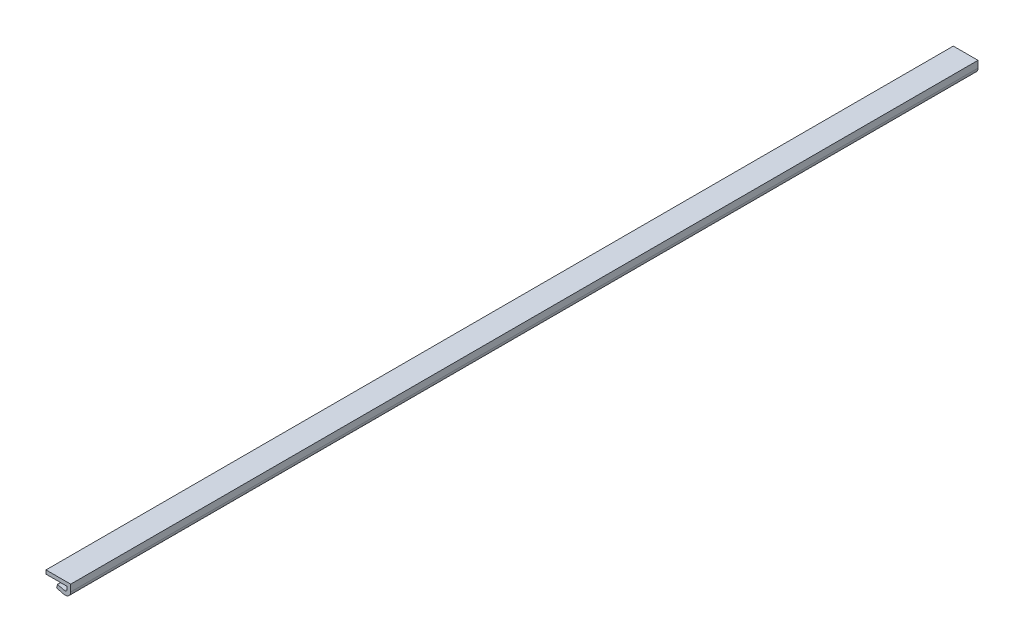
ISO-10303-21;
HEADER;
FILE_DESCRIPTION(('STEP AP214'),'2;1');
FILE_NAME('part.step','',(''),(''),'','','');
FILE_SCHEMA(('AUTOMOTIVE_DESIGN { 1 0 10303 214 1 1 1 1 }'));
ENDSEC;
DATA;
#1=APPLICATION_CONTEXT('core data for automotive mechanical design processes');
#2=APPLICATION_PROTOCOL_DEFINITION('international standard','automotive_design',2000,#1);
#3=PRODUCT_CONTEXT('',#1,'mechanical');
#4=PRODUCT('Part','Part','',(#3));
#5=PRODUCT_RELATED_PRODUCT_CATEGORY('part','',(#4));
#6=PRODUCT_DEFINITION_FORMATION('','',#4);
#7=PRODUCT_DEFINITION_CONTEXT('part definition',#1,'design');
#8=PRODUCT_DEFINITION('design','',#6,#7);
#9=PRODUCT_DEFINITION_SHAPE('','',#8);
#10=(LENGTH_UNIT() NAMED_UNIT(*) SI_UNIT(.MILLI.,.METRE.));
#11=(NAMED_UNIT(*) PLANE_ANGLE_UNIT() SI_UNIT($,.RADIAN.));
#12=(NAMED_UNIT(*) SI_UNIT($,.STERADIAN.) SOLID_ANGLE_UNIT());
#13=UNCERTAINTY_MEASURE_WITH_UNIT(LENGTH_MEASURE(1.E-05),#10,'distance_accuracy_value','');
#14=(GEOMETRIC_REPRESENTATION_CONTEXT(3) GLOBAL_UNCERTAINTY_ASSIGNED_CONTEXT((#13)) GLOBAL_UNIT_ASSIGNED_CONTEXT((#10,
#11,#12)) REPRESENTATION_CONTEXT('',''));
#15=CARTESIAN_POINT('',(0.,0.,0.));
#16=DIRECTION('',(0.,0.,1.));
#17=DIRECTION('',(1.,0.,0.));
#18=AXIS2_PLACEMENT_3D('',#15,#16,#17);
#19=CARTESIAN_POINT('',(0.,0.,735.));
#20=DIRECTION('',(1.,0.,0.));
#21=DIRECTION('',(0.,1.,0.));
#22=AXIS2_PLACEMENT_3D('',#19,#20,#21);
#23=PLANE('',#22);
#24=DIRECTION('',(0.,-1.,0.));
#25=VECTOR('',#24,1.);
#26=CARTESIAN_POINT('',(0.,0.,0.));
#27=LINE('',#26,#25);
#28=CARTESIAN_POINT('',(0.,0.,0.));
#29=VERTEX_POINT('',#28);
#30=CARTESIAN_POINT('',(0.,-3.,0.));
#31=VERTEX_POINT('',#30);
#32=EDGE_CURVE('E119',#29,#31,#27,.T.);
#33=ORIENTED_EDGE('',*,*,#32,.T.);
#34=DIRECTION('',(0.,0.,-1.));
#35=VECTOR('',#34,1.);
#36=CARTESIAN_POINT('',(0.,-3.,735.));
#37=LINE('',#36,#35);
#38=CARTESIAN_POINT('',(0.,-3.,735.));
#39=VERTEX_POINT('',#38);
#40=EDGE_CURVE('E11',#39,#31,#37,.T.);
#41=ORIENTED_EDGE('',*,*,#40,.F.);
#42=DIRECTION('',(0.,-1.,0.));
#43=VECTOR('',#42,1.);
#44=CARTESIAN_POINT('',(0.,0.,735.));
#45=LINE('',#44,#43);
#46=CARTESIAN_POINT('',(0.,0.,735.));
#47=VERTEX_POINT('',#46);
#48=EDGE_CURVE('E162',#47,#39,#45,.T.);
#49=ORIENTED_EDGE('',*,*,#48,.F.);
#50=DIRECTION('',(0.,0.,-1.));
#51=VECTOR('',#50,1.);
#52=CARTESIAN_POINT('',(0.,0.,735.));
#53=LINE('',#52,#51);
#54=EDGE_CURVE('E133',#47,#29,#53,.T.);
#55=ORIENTED_EDGE('',*,*,#54,.T.);
#56=EDGE_LOOP('',(#33,#41,#49,#55));
#57=FACE_BOUND('',#56,.T.);
#58=ADVANCED_FACE('F38',(#57),#23,.F.);
#59=CARTESIAN_POINT('',(0.,-3.,735.));
#60=DIRECTION('',(0.,1.,0.));
#61=DIRECTION('',(-1.,0.,0.));
#62=AXIS2_PLACEMENT_3D('',#59,#60,#61);
#63=PLANE('',#62);
#64=DIRECTION('',(1.,0.,0.));
#65=VECTOR('',#64,1.);
#66=CARTESIAN_POINT('',(0.,-3.,0.));
#67=LINE('',#66,#65);
#68=CARTESIAN_POINT('',(17.,-3.,0.));
#69=VERTEX_POINT('',#68);
#70=EDGE_CURVE('E115',#31,#69,#67,.T.);
#71=ORIENTED_EDGE('',*,*,#70,.T.);
#72=DIRECTION('',(0.,0.,-1.));
#73=VECTOR('',#72,1.);
#74=CARTESIAN_POINT('',(17.,-3.,735.));
#75=LINE('',#74,#73);
#76=CARTESIAN_POINT('',(17.,-3.,735.));
#77=VERTEX_POINT('',#76);
#78=EDGE_CURVE('E46',#77,#69,#75,.T.);
#79=ORIENTED_EDGE('',*,*,#78,.F.);
#80=DIRECTION('',(1.,0.,0.));
#81=VECTOR('',#80,1.);
#82=CARTESIAN_POINT('',(0.,-3.,735.));
#83=LINE('',#82,#81);
#84=EDGE_CURVE('E129',#39,#77,#83,.T.);
#85=ORIENTED_EDGE('',*,*,#84,.F.);
#86=ORIENTED_EDGE('',*,*,#40,.T.);
#87=EDGE_LOOP('',(#71,#79,#85,#86));
#88=FACE_BOUND('',#87,.T.);
#89=ADVANCED_FACE('F128',(#88),#63,.F.);
#90=CARTESIAN_POINT('',(17.,-3.,735.));
#91=DIRECTION('',(1.,0.,0.));
#92=DIRECTION('',(0.,0.,-1.));
#93=AXIS2_PLACEMENT_3D('',#90,#91,#92);
#94=PLANE('',#93);
#95=DIRECTION('',(0.,-1.,0.));
#96=VECTOR('',#95,1.);
#97=CARTESIAN_POINT('',(17.,-3.,0.));
#98=LINE('',#97,#96);
#99=CARTESIAN_POINT('',(17.,-5.49999999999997,0.));
#100=VERTEX_POINT('',#99);
#101=EDGE_CURVE('E121',#69,#100,#98,.T.);
#102=ORIENTED_EDGE('',*,*,#101,.T.);
#103=DIRECTION('',(0.,0.,-1.));
#104=VECTOR('',#103,1.);
#105=CARTESIAN_POINT('',(17.,-5.49999999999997,735.));
#106=LINE('',#105,#104);
#107=CARTESIAN_POINT('',(17.,-5.49999999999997,735.));
#108=VERTEX_POINT('',#107);
#109=EDGE_CURVE('E213',#108,#100,#106,.T.);
#110=ORIENTED_EDGE('',*,*,#109,.F.);
#111=DIRECTION('',(0.,-1.,0.));
#112=VECTOR('',#111,1.);
#113=CARTESIAN_POINT('',(17.,-3.,735.));
#114=LINE('',#113,#112);
#115=EDGE_CURVE('E167',#77,#108,#114,.T.);
#116=ORIENTED_EDGE('',*,*,#115,.F.);
#117=ORIENTED_EDGE('',*,*,#78,.T.);
#118=EDGE_LOOP('',(#102,#110,#116,#117));
#119=FACE_BOUND('',#118,.T.);
#120=ADVANCED_FACE('F219',(#119),#94,.F.);
#121=CARTESIAN_POINT('',(15.5,-5.5,735.));
#122=DIRECTION('',(0.,0.,-1.));
#123=DIRECTION('',(-1.,0.,0.));
#124=AXIS2_PLACEMENT_3D('',#121,#122,#123);
#125=CYLINDRICAL_SURFACE('',#124,1.5);
#126=CARTESIAN_POINT('',(15.5,-5.5,0.));
#127=DIRECTION('',(0.,0.,-1.));
#128=DIRECTION('',(1.,0.,0.));
#129=AXIS2_PLACEMENT_3D('',#126,#127,#128);
#130=CIRCLE('',#129,1.5);
#131=CARTESIAN_POINT('',(15.1371171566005,-6.955443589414,0.));
#132=VERTEX_POINT('',#131);
#133=EDGE_CURVE('E141',#100,#132,#130,.T.);
#134=ORIENTED_EDGE('',*,*,#133,.T.);
#135=DIRECTION('',(0.,0.,-1.));
#136=VECTOR('',#135,1.);
#137=CARTESIAN_POINT('',(15.1371171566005,-6.955443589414,735.));
#138=LINE('',#137,#136);
#139=CARTESIAN_POINT('',(15.1371171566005,-6.955443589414,735.));
#140=VERTEX_POINT('',#139);
#141=EDGE_CURVE('E209',#140,#132,#138,.T.);
#142=ORIENTED_EDGE('',*,*,#141,.F.);
#143=CARTESIAN_POINT('',(15.5,-5.5,735.));
#144=DIRECTION('',(0.,0.,-1.));
#145=DIRECTION('',(1.,0.,0.));
#146=AXIS2_PLACEMENT_3D('',#143,#144,#145);
#147=CIRCLE('',#146,1.5);
#148=EDGE_CURVE('E169',#108,#140,#147,.T.);
#149=ORIENTED_EDGE('',*,*,#148,.F.);
#150=ORIENTED_EDGE('',*,*,#109,.T.);
#151=EDGE_LOOP('',(#134,#142,#149,#150));
#152=FACE_BOUND('',#151,.T.);
#153=ADVANCED_FACE('F227',(#152),#125,.F.);
#154=CARTESIAN_POINT('',(9.2996517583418,-5.5,735.));
#155=DIRECTION('',(-0.241921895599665,-0.970295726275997,0.));
#156=DIRECTION('',(0.970295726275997,-0.241921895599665,0.));
#157=AXIS2_PLACEMENT_3D('',#154,#155,#156);
#158=PLANE('',#157);
#159=DIRECTION('',(-0.970295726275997,0.241921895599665,0.));
#160=VECTOR('',#159,1.);
#161=CARTESIAN_POINT('',(9.2996517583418,-5.5,0.));
#162=LINE('',#161,#160);
#163=CARTESIAN_POINT('',(9.2996517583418,-5.5,0.));
#164=VERTEX_POINT('',#163);
#165=EDGE_CURVE('E144',#132,#164,#162,.T.);
#166=ORIENTED_EDGE('',*,*,#165,.T.);
#167=DIRECTION('',(0.,0.,-1.));
#168=VECTOR('',#167,1.);
#169=CARTESIAN_POINT('',(9.2996517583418,-5.5,735.));
#170=LINE('',#169,#168);
#171=CARTESIAN_POINT('',(9.2996517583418,-5.5,735.));
#172=VERTEX_POINT('',#171);
#173=EDGE_CURVE('E205',#172,#164,#170,.T.);
#174=ORIENTED_EDGE('',*,*,#173,.F.);
#175=DIRECTION('',(-0.970295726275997,0.241921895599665,0.));
#176=VECTOR('',#175,1.);
#177=CARTESIAN_POINT('',(9.2996517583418,-5.5,735.));
#178=LINE('',#177,#176);
#179=EDGE_CURVE('E172',#140,#172,#178,.T.);
#180=ORIENTED_EDGE('',*,*,#179,.F.);
#181=ORIENTED_EDGE('',*,*,#141,.T.);
#182=EDGE_LOOP('',(#166,#174,#180,#181));
#183=FACE_BOUND('',#182,.T.);
#184=ADVANCED_FACE('F230',(#183),#158,.F.);
#185=CARTESIAN_POINT('',(8.57388607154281,-8.41088717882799,735.));
#186=DIRECTION('',(0.970295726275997,-0.241921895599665,0.));
#187=DIRECTION('',(0.241921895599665,0.970295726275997,0.));
#188=AXIS2_PLACEMENT_3D('',#185,#186,#187);
#189=PLANE('',#188);
#190=DIRECTION('',(-0.241921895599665,-0.970295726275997,0.));
#191=VECTOR('',#190,1.);
#192=CARTESIAN_POINT('',(8.57388607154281,-8.41088717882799,0.));
#193=LINE('',#192,#191);
#194=CARTESIAN_POINT('',(8.57388607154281,-8.41088717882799,0.));
#195=VERTEX_POINT('',#194);
#196=EDGE_CURVE('E147',#164,#195,#193,.T.);
#197=ORIENTED_EDGE('',*,*,#196,.T.);
#198=DIRECTION('',(0.,0.,-1.));
#199=VECTOR('',#198,1.);
#200=CARTESIAN_POINT('',(8.57388607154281,-8.41088717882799,735.));
#201=LINE('',#200,#199);
#202=CARTESIAN_POINT('',(8.57388607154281,-8.41088717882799,735.));
#203=VERTEX_POINT('',#202);
#204=EDGE_CURVE('E201',#203,#195,#201,.T.);
#205=ORIENTED_EDGE('',*,*,#204,.F.);
#206=DIRECTION('',(-0.241921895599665,-0.970295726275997,0.));
#207=VECTOR('',#206,1.);
#208=CARTESIAN_POINT('',(8.57388607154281,-8.41088717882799,735.));
#209=LINE('',#208,#207);
#210=EDGE_CURVE('E175',#172,#203,#209,.T.);
#211=ORIENTED_EDGE('',*,*,#210,.F.);
#212=ORIENTED_EDGE('',*,*,#173,.T.);
#213=EDGE_LOOP('',(#197,#205,#211,#212));
#214=FACE_BOUND('',#213,.T.);
#215=ADVANCED_FACE('F235',(#214),#189,.F.);
#216=CARTESIAN_POINT('',(14.4113514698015,-9.86633076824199,735.));
#217=DIRECTION('',(0.241921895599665,0.970295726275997,0.));
#218=DIRECTION('',(-0.970295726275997,0.241921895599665,0.));
#219=AXIS2_PLACEMENT_3D('',#216,#217,#218);
#220=PLANE('',#219);
#221=DIRECTION('',(0.970295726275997,-0.241921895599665,0.));
#222=VECTOR('',#221,1.);
#223=CARTESIAN_POINT('',(14.4113514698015,-9.86633076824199,0.));
#224=LINE('',#223,#222);
#225=CARTESIAN_POINT('',(14.4113514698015,-9.86633076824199,0.));
#226=VERTEX_POINT('',#225);
#227=EDGE_CURVE('E150',#195,#226,#224,.T.);
#228=ORIENTED_EDGE('',*,*,#227,.T.);
#229=DIRECTION('',(0.,0.,-1.));
#230=VECTOR('',#229,1.);
#231=CARTESIAN_POINT('',(14.4113514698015,-9.86633076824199,735.));
#232=LINE('',#231,#230);
#233=CARTESIAN_POINT('',(14.4113514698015,-9.86633076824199,735.));
#234=VERTEX_POINT('',#233);
#235=EDGE_CURVE('E197',#234,#226,#232,.T.);
#236=ORIENTED_EDGE('',*,*,#235,.F.);
#237=DIRECTION('',(0.970295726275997,-0.241921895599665,0.));
#238=VECTOR('',#237,1.);
#239=CARTESIAN_POINT('',(14.4113514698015,-9.86633076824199,735.));
#240=LINE('',#239,#238);
#241=EDGE_CURVE('E178',#203,#234,#240,.T.);
#242=ORIENTED_EDGE('',*,*,#241,.F.);
#243=ORIENTED_EDGE('',*,*,#204,.T.);
#244=EDGE_LOOP('',(#228,#236,#242,#243));
#245=FACE_BOUND('',#244,.T.);
#246=ADVANCED_FACE('F241',(#245),#220,.F.);
#247=CARTESIAN_POINT('',(15.5,-5.5,735.));
#248=DIRECTION('',(0.,0.,-1.));
#249=DIRECTION('',(-1.,0.,0.));
#250=AXIS2_PLACEMENT_3D('',#247,#248,#249);
#251=CYLINDRICAL_SURFACE('',#250,4.5);
#252=CARTESIAN_POINT('',(15.5,-5.5,0.));
#253=DIRECTION('',(0.,0.,1.));
#254=DIRECTION('',(-1.,0.,0.));
#255=AXIS2_PLACEMENT_3D('',#252,#253,#254);
#256=CIRCLE('',#255,4.5);
#257=CARTESIAN_POINT('',(20.,-5.5,0.));
#258=VERTEX_POINT('',#257);
#259=EDGE_CURVE('E153',#226,#258,#256,.T.);
#260=ORIENTED_EDGE('',*,*,#259,.T.);
#261=DIRECTION('',(0.,0.,-1.));
#262=VECTOR('',#261,1.);
#263=CARTESIAN_POINT('',(20.,-5.5,735.));
#264=LINE('',#263,#262);
#265=CARTESIAN_POINT('',(20.,-5.5,735.));
#266=VERTEX_POINT('',#265);
#267=EDGE_CURVE('E194',#266,#258,#264,.T.);
#268=ORIENTED_EDGE('',*,*,#267,.F.);
#269=CARTESIAN_POINT('',(15.5,-5.5,735.));
#270=DIRECTION('',(0.,0.,1.));
#271=DIRECTION('',(-1.,0.,0.));
#272=AXIS2_PLACEMENT_3D('',#269,#270,#271);
#273=CIRCLE('',#272,4.5);
#274=EDGE_CURVE('E181',#234,#266,#273,.T.);
#275=ORIENTED_EDGE('',*,*,#274,.F.);
#276=ORIENTED_EDGE('',*,*,#235,.T.);
#277=EDGE_LOOP('',(#260,#268,#275,#276));
#278=FACE_BOUND('',#277,.T.);
#279=ADVANCED_FACE('F245',(#278),#251,.T.);
#280=CARTESIAN_POINT('',(20.,0.,735.));
#281=DIRECTION('',(-1.,0.,0.));
#282=DIRECTION('',(0.,0.,1.));
#283=AXIS2_PLACEMENT_3D('',#280,#281,#282);
#284=PLANE('',#283);
#285=DIRECTION('',(0.,1.,0.));
#286=VECTOR('',#285,1.);
#287=CARTESIAN_POINT('',(20.,0.,0.));
#288=LINE('',#287,#286);
#289=CARTESIAN_POINT('',(20.,0.,0.));
#290=VERTEX_POINT('',#289);
#291=EDGE_CURVE('E156',#258,#290,#288,.T.);
#292=ORIENTED_EDGE('',*,*,#291,.T.);
#293=DIRECTION('',(0.,0.,-1.));
#294=VECTOR('',#293,1.);
#295=CARTESIAN_POINT('',(20.,0.,735.));
#296=LINE('',#295,#294);
#297=CARTESIAN_POINT('',(20.,0.,735.));
#298=VERTEX_POINT('',#297);
#299=EDGE_CURVE('E190',#298,#290,#296,.T.);
#300=ORIENTED_EDGE('',*,*,#299,.F.);
#301=DIRECTION('',(0.,1.,0.));
#302=VECTOR('',#301,1.);
#303=CARTESIAN_POINT('',(20.,0.,735.));
#304=LINE('',#303,#302);
#305=EDGE_CURVE('E58',#266,#298,#304,.T.);
#306=ORIENTED_EDGE('',*,*,#305,.F.);
#307=ORIENTED_EDGE('',*,*,#267,.T.);
#308=EDGE_LOOP('',(#292,#300,#306,#307));
#309=FACE_BOUND('',#308,.T.);
#310=ADVANCED_FACE('F248',(#309),#284,.F.);
#311=CARTESIAN_POINT('',(0.,0.,735.));
#312=DIRECTION('',(0.,-1.,0.));
#313=DIRECTION('',(0.,0.,-1.));
#314=AXIS2_PLACEMENT_3D('',#311,#312,#313);
#315=PLANE('',#314);
#316=DIRECTION('',(-1.,0.,0.));
#317=VECTOR('',#316,1.);
#318=CARTESIAN_POINT('',(0.,0.,0.));
#319=LINE('',#318,#317);
#320=EDGE_CURVE('E159',#290,#29,#319,.T.);
#321=ORIENTED_EDGE('',*,*,#320,.T.);
#322=ORIENTED_EDGE('',*,*,#54,.F.);
#323=DIRECTION('',(-1.,0.,0.));
#324=VECTOR('',#323,1.);
#325=CARTESIAN_POINT('',(0.,0.,735.));
#326=LINE('',#325,#324);
#327=EDGE_CURVE('E53',#298,#47,#326,.T.);
#328=ORIENTED_EDGE('',*,*,#327,.F.);
#329=ORIENTED_EDGE('',*,*,#299,.T.);
#330=EDGE_LOOP('',(#321,#322,#328,#329));
#331=FACE_BOUND('',#330,.T.);
#332=ADVANCED_FACE('F250',(#331),#315,.F.);
#333=CARTESIAN_POINT('',(15.5,-5.5,735.));
#334=DIRECTION('',(0.,0.,1.));
#335=DIRECTION('',(1.,0.,0.));
#336=AXIS2_PLACEMENT_3D('',#333,#334,#335);
#337=PLANE('',#336);
#338=ORIENTED_EDGE('',*,*,#48,.T.);
#339=ORIENTED_EDGE('',*,*,#84,.T.);
#340=ORIENTED_EDGE('',*,*,#115,.T.);
#341=ORIENTED_EDGE('',*,*,#148,.T.);
#342=ORIENTED_EDGE('',*,*,#179,.T.);
#343=ORIENTED_EDGE('',*,*,#210,.T.);
#344=ORIENTED_EDGE('',*,*,#241,.T.);
#345=ORIENTED_EDGE('',*,*,#274,.T.);
#346=ORIENTED_EDGE('',*,*,#305,.T.);
#347=ORIENTED_EDGE('',*,*,#327,.T.);
#348=EDGE_LOOP('',(#338,#339,#340,#341,#342,#343,#344,#345,#346,#347));
#349=FACE_BOUND('',#348,.T.);
#350=ADVANCED_FACE('F222',(#349),#337,.T.);
#351=CARTESIAN_POINT('',(15.5,-5.5,0.));
#352=DIRECTION('',(0.,0.,1.));
#353=DIRECTION('',(1.,0.,0.));
#354=AXIS2_PLACEMENT_3D('',#351,#352,#353);
#355=PLANE('',#354);
#356=ORIENTED_EDGE('',*,*,#32,.F.);
#357=ORIENTED_EDGE('',*,*,#320,.F.);
#358=ORIENTED_EDGE('',*,*,#291,.F.);
#359=ORIENTED_EDGE('',*,*,#259,.F.);
#360=ORIENTED_EDGE('',*,*,#227,.F.);
#361=ORIENTED_EDGE('',*,*,#196,.F.);
#362=ORIENTED_EDGE('',*,*,#165,.F.);
#363=ORIENTED_EDGE('',*,*,#133,.F.);
#364=ORIENTED_EDGE('',*,*,#101,.F.);
#365=ORIENTED_EDGE('',*,*,#70,.F.);
#366=EDGE_LOOP('',(#356,#357,#358,#359,#360,#361,#362,#363,#364,#365));
#367=FACE_BOUND('',#366,.T.);
#368=ADVANCED_FACE('F116',(#367),#355,.F.);
#369=CLOSED_SHELL('',(#58,#89,#120,#153,#184,#215,#246,#279,#310,#332,#350,#368));
#370=MANIFOLD_SOLID_BREP('B2',#369);
#371=ADVANCED_BREP_SHAPE_REPRESENTATION('',(#18,#370),#14);
#372=SHAPE_DEFINITION_REPRESENTATION(#9,#371);
ENDSEC;
END-ISO-10303-21;
